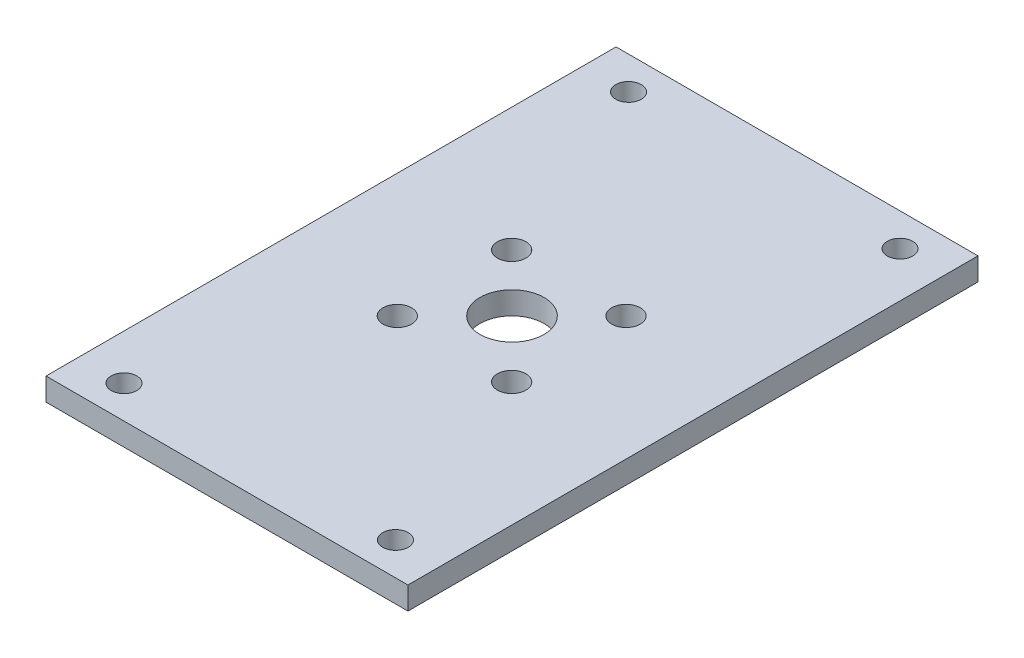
from build123d import *

# Parameters (mm, degrees)
SKETCH1_W           = 50.8
SKETCH1_H           = 80.01
BOSS_EXTRUDE1_DEPTH = 3.175
SKETCH2_R           = 2
CUT_EXTRUDE2_DEPTH  = 48.493585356
CIRPATTERN1_COUNT   = 4
SKETCH3_R           = 1.7907
CUT_EXTRUDE7_DEPTH  = 3.175
SKETCH5_R           = 4.5
CUT_EXTRUDE8_DEPTH  = 3.175
CIRPATTERN2_COUNT   = 4


with BuildPart() as part:
    # Sketch1 → Boss-Extrude1 (new body)
    with BuildSketch(Plane(origin=(0, 0, 0), x_dir=(1, 0, 0), z_dir=(0, 1, 0))):
        Rectangle(SKETCH1_W, SKETCH1_H)
    extrude(amount=BOSS_EXTRUDE1_DEPTH)

    # Sketch2 → Cut-Extrude2 (cut, through all)
    with BuildSketch(Plane(origin=(0, 0, 0), x_dir=(1, 0, 0), z_dir=(0, 1, 0))):
        with Locations(Location((8.000000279, 8.000000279, 0), (0, 0, 270))):
            Circle(SKETCH2_R)
    cut_extrude2 = extrude(amount=CUT_EXTRUDE2_DEPTH, mode=Mode.SUBTRACT)

    # CirPattern1: Cut-Extrude2 ×4 about axis
    cirpattern1_axis = Axis((-0.024810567, 0, 0.024810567), (0, 1, 0))
    for i in range(1, CIRPATTERN1_COUNT):
        add(cut_extrude2.rotate(cirpattern1_axis, i * 360 / CIRPATTERN1_COUNT), mode=Mode.SUBTRACT)

    # Sketch3 → Cut-Extrude7 (cut)
    with BuildSketch(Plane(origin=(0, 0, 0), x_dir=(1, 0, 0), z_dir=(0, 1, 0))):
        with Locations(Location((-19.05, 35.4076, 0), (0, 0, 90))):
            Circle(SKETCH3_R)
        with Locations(Location((19.05, 35.4076, 0), (0, 0, 90))):
            Circle(SKETCH3_R)
    cut_extrude7 = extrude(amount=CUT_EXTRUDE7_DEPTH, mode=Mode.SUBTRACT)

    # Sketch5 → Cut-Extrude8 (cut)
    with BuildSketch(Plane(origin=(0, 0, 0), x_dir=(1, 0, 0), z_dir=(0, 1, 0))):
        with Locations(Location((0, 0, 0), (0, 0, 90))):
            Circle(SKETCH5_R)
    extrude(amount=CUT_EXTRUDE8_DEPTH, mode=Mode.SUBTRACT)

    # CirPattern2: Cut-Extrude7 ×4 about axis
    cirpattern2_axis = Axis((0, 3.175, 0), (0, -1, 0))
    for i in range(1, CIRPATTERN2_COUNT):
        add(cut_extrude7.rotate(cirpattern2_axis, i * 360 / CIRPATTERN2_COUNT), mode=Mode.SUBTRACT)


solid = part.part
